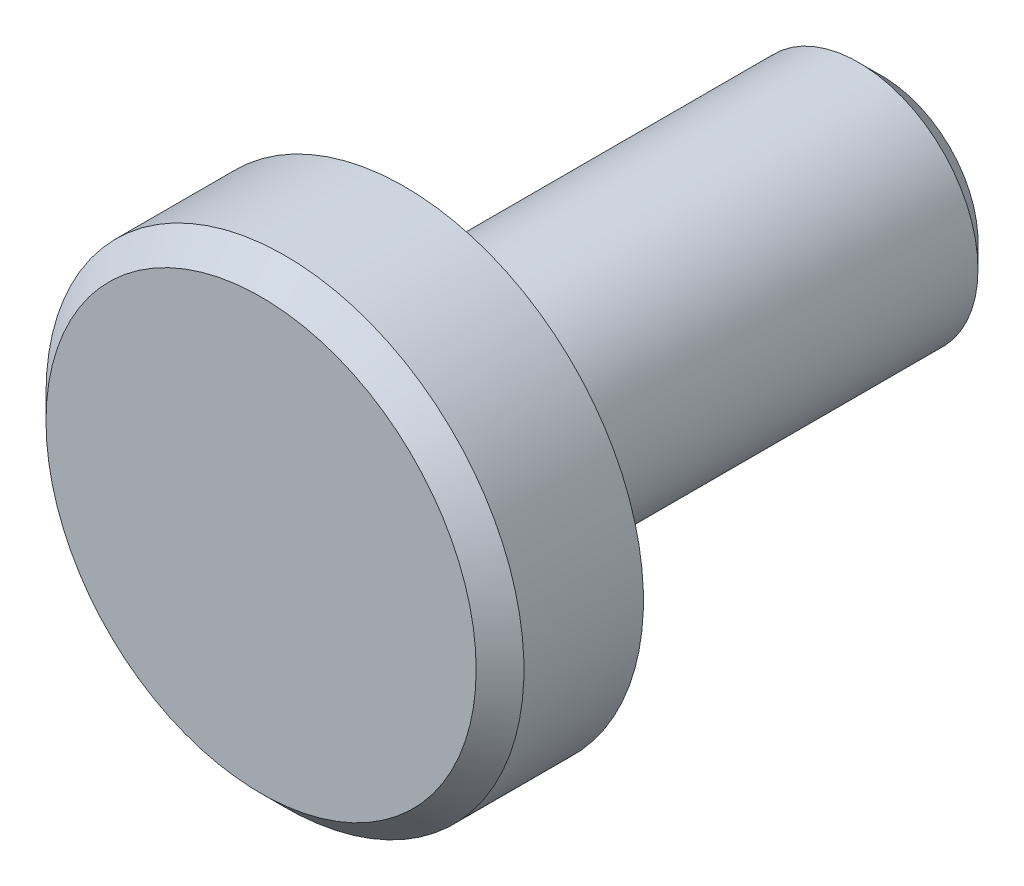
ISO-10303-21;
HEADER;
FILE_DESCRIPTION(('STEP AP214'),'2;1');
FILE_NAME('part.step','',(''),(''),'','','');
FILE_SCHEMA(('AUTOMOTIVE_DESIGN { 1 0 10303 214 1 1 1 1 }'));
ENDSEC;
DATA;
#1=APPLICATION_CONTEXT('core data for automotive mechanical design processes');
#2=APPLICATION_PROTOCOL_DEFINITION('international standard','automotive_design',2000,#1);
#3=PRODUCT_CONTEXT('',#1,'mechanical');
#4=PRODUCT('Part','Part','',(#3));
#5=PRODUCT_RELATED_PRODUCT_CATEGORY('part','',(#4));
#6=PRODUCT_DEFINITION_FORMATION('','',#4);
#7=PRODUCT_DEFINITION_CONTEXT('part definition',#1,'design');
#8=PRODUCT_DEFINITION('design','',#6,#7);
#9=PRODUCT_DEFINITION_SHAPE('','',#8);
#10=(LENGTH_UNIT() NAMED_UNIT(*) SI_UNIT(.MILLI.,.METRE.));
#11=(NAMED_UNIT(*) PLANE_ANGLE_UNIT() SI_UNIT($,.RADIAN.));
#12=(NAMED_UNIT(*) SI_UNIT($,.STERADIAN.) SOLID_ANGLE_UNIT());
#13=UNCERTAINTY_MEASURE_WITH_UNIT(LENGTH_MEASURE(1.E-05),#10,'distance_accuracy_value','');
#14=(GEOMETRIC_REPRESENTATION_CONTEXT(3) GLOBAL_UNCERTAINTY_ASSIGNED_CONTEXT((#13)) GLOBAL_UNIT_ASSIGNED_CONTEXT((#10,
#11,#12)) REPRESENTATION_CONTEXT('',''));
#15=CARTESIAN_POINT('',(0.,0.,0.));
#16=DIRECTION('',(0.,0.,1.));
#17=DIRECTION('',(1.,0.,0.));
#18=AXIS2_PLACEMENT_3D('',#15,#16,#17);
#19=CARTESIAN_POINT('',(0.,0.,4.7625));
#20=DIRECTION('',(0.,0.,-1.));
#21=DIRECTION('',(-1.,0.,0.));
#22=AXIS2_PLACEMENT_3D('',#19,#20,#21);
#23=CYLINDRICAL_SURFACE('',#22,7.9375);
#24=CARTESIAN_POINT('',(0.,0.,3.96874999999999));
#25=DIRECTION('',(0.,0.,1.));
#26=DIRECTION('',(1.,0.,0.));
#27=AXIS2_PLACEMENT_3D('',#24,#25,#26);
#28=CIRCLE('',#27,7.9375);
#29=CARTESIAN_POINT('',(-7.9375,0.,3.96874999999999));
#30=VERTEX_POINT('',#29);
#31=EDGE_CURVE('E41',#30,#30,#28,.F.);
#32=CARTESIAN_POINT('',(0.,0.,0.));
#33=DIRECTION('',(0.,0.,1.));
#34=DIRECTION('',(1.,0.,0.));
#35=AXIS2_PLACEMENT_3D('',#32,#33,#34);
#36=CIRCLE('',#35,7.9375);
#37=CARTESIAN_POINT('',(-7.9375,0.,0.));
#38=VERTEX_POINT('',#37);
#39=EDGE_CURVE('E53',#38,#38,#36,.T.);
#40=CARTESIAN_POINT('',(-7.9375,0.,3.96874999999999));
#41=CARTESIAN_POINT('',(-7.9375,0.,3.92740885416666));
#42=CARTESIAN_POINT('',(-7.9375,0.,3.88606770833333));
#43=CARTESIAN_POINT('',(-7.9375,0.,3.80338541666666));
#44=CARTESIAN_POINT('',(-7.9375,0.,3.76204427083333));
#45=CARTESIAN_POINT('',(-7.9375,0.,3.67936197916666));
#46=CARTESIAN_POINT('',(-7.9375,0.,3.63802083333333));
#47=CARTESIAN_POINT('',(-7.9375,0.,3.55533854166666));
#48=CARTESIAN_POINT('',(-7.9375,0.,3.51399739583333));
#49=CARTESIAN_POINT('',(-7.9375,0.,3.43131510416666));
#50=CARTESIAN_POINT('',(-7.9375,0.,3.38997395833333));
#51=CARTESIAN_POINT('',(-7.9375,0.,3.30729166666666));
#52=CARTESIAN_POINT('',(-7.9375,0.,3.26595052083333));
#53=CARTESIAN_POINT('',(-7.9375,0.,3.18326822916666));
#54=CARTESIAN_POINT('',(-7.9375,0.,3.14192708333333));
#55=CARTESIAN_POINT('',(-7.9375,0.,3.05924479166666));
#56=CARTESIAN_POINT('',(-7.9375,0.,3.01790364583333));
#57=CARTESIAN_POINT('',(-7.9375,0.,2.93522135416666));
#58=CARTESIAN_POINT('',(-7.9375,0.,2.89388020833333));
#59=CARTESIAN_POINT('',(-7.9375,0.,2.81119791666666));
#60=CARTESIAN_POINT('',(-7.9375,0.,2.76985677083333));
#61=CARTESIAN_POINT('',(-7.9375,0.,2.68717447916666));
#62=CARTESIAN_POINT('',(-7.9375,0.,2.64583333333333));
#63=CARTESIAN_POINT('',(-7.9375,0.,2.56315104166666));
#64=CARTESIAN_POINT('',(-7.9375,0.,2.52180989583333));
#65=CARTESIAN_POINT('',(-7.9375,0.,2.43912760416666));
#66=CARTESIAN_POINT('',(-7.9375,0.,2.39778645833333));
#67=CARTESIAN_POINT('',(-7.9375,0.,2.31510416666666));
#68=CARTESIAN_POINT('',(-7.9375,0.,2.27376302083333));
#69=CARTESIAN_POINT('',(-7.9375,0.,2.19108072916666));
#70=CARTESIAN_POINT('',(-7.9375,0.,2.14973958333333));
#71=CARTESIAN_POINT('',(-7.9375,0.,2.06705729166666));
#72=CARTESIAN_POINT('',(-7.9375,0.,2.02571614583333));
#73=CARTESIAN_POINT('',(-7.9375,0.,1.94303385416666));
#74=CARTESIAN_POINT('',(-7.9375,0.,1.90169270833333));
#75=CARTESIAN_POINT('',(-7.9375,0.,1.81901041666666));
#76=CARTESIAN_POINT('',(-7.9375,0.,1.77766927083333));
#77=CARTESIAN_POINT('',(-7.9375,0.,1.69498697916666));
#78=CARTESIAN_POINT('',(-7.9375,0.,1.65364583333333));
#79=CARTESIAN_POINT('',(-7.9375,0.,1.57096354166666));
#80=CARTESIAN_POINT('',(-7.9375,0.,1.52962239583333));
#81=CARTESIAN_POINT('',(-7.9375,0.,1.44694010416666));
#82=CARTESIAN_POINT('',(-7.9375,0.,1.40559895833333));
#83=CARTESIAN_POINT('',(-7.9375,0.,1.32291666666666));
#84=CARTESIAN_POINT('',(-7.9375,0.,1.28157552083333));
#85=CARTESIAN_POINT('',(-7.9375,0.,1.19889322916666));
#86=CARTESIAN_POINT('',(-7.9375,0.,1.15755208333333));
#87=CARTESIAN_POINT('',(-7.9375,0.,1.07486979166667));
#88=CARTESIAN_POINT('',(-7.9375,0.,1.03352864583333));
#89=CARTESIAN_POINT('',(-7.9375,0.,0.950846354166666));
#90=CARTESIAN_POINT('',(-7.9375,0.,0.909505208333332));
#91=CARTESIAN_POINT('',(-7.9375,0.,0.826822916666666));
#92=CARTESIAN_POINT('',(-7.9375,0.,0.785481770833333));
#93=CARTESIAN_POINT('',(-7.9375,0.,0.702799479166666));
#94=CARTESIAN_POINT('',(-7.9375,0.,0.661458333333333));
#95=CARTESIAN_POINT('',(-7.9375,0.,0.578776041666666));
#96=CARTESIAN_POINT('',(-7.9375,0.,0.537434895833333));
#97=CARTESIAN_POINT('',(-7.9375,0.,0.454752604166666));
#98=CARTESIAN_POINT('',(-7.9375,0.,0.413411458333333));
#99=CARTESIAN_POINT('',(-7.9375,0.,0.330729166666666));
#100=CARTESIAN_POINT('',(-7.9375,0.,0.289388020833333));
#101=CARTESIAN_POINT('',(-7.9375,0.,0.206705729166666));
#102=CARTESIAN_POINT('',(-7.9375,0.,0.165364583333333));
#103=CARTESIAN_POINT('',(-7.9375,0.,0.0826822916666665));
#104=CARTESIAN_POINT('',(-7.9375,0.,0.0413411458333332));
#105=CARTESIAN_POINT('',(-7.9375,0.,0.));
#106=B_SPLINE_CURVE_WITH_KNOTS('',3,(#40,#41,#42,#43,#44,#45,#46,#47,#48,#49,#50,#51,#52,#53,
#54,#55,#56,#57,#58,#59,#60,#61,#62,#63,#64,#65,#66,#67,#68,#69,#70,#71,#72,#73,#74,#75,#76,#77,
#78,#79,#80,#81,#82,#83,#84,#85,#86,#87,#88,#89,#90,#91,#92,#93,#94,#95,#96,#97,#98,#99,#100,
#101,#102,#103,#104,#105),.UNSPECIFIED.,.F.,.F.,(4,2,2,2,2,2,2,2,2,2,2,2,2,2,2,2,2,2,2,2,2,2,2,
2,2,2,2,2,2,2,2,2,4),(0.,0.124023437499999,0.248046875,0.372070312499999,0.496093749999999,
0.620117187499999,0.744140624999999,0.868164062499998,0.992187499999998,1.1162109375,
1.240234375,1.3642578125,1.48828125,1.6123046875,1.736328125,1.8603515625,1.984375,2.1083984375,
2.232421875,2.3564453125,2.48046875,2.6044921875,2.728515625,2.8525390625,2.9765625,
3.1005859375,3.22460937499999,3.34863281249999,3.47265624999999,3.59667968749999,
3.72070312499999,3.84472656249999,3.96874999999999),.UNSPECIFIED.);
#107=EDGE_CURVE('BSEAM30',#30,#38,#106,.T.);
#108=ORIENTED_EDGE('',*,*,#31,.T.);
#109=ORIENTED_EDGE('',*,*,#39,.T.);
#110=ORIENTED_EDGE('',*,*,#107,.T.);
#111=ORIENTED_EDGE('',*,*,#107,.F.);
#112=EDGE_LOOP('',(#108,#110,#109,#111));
#113=FACE_BOUND('',#112,.T.);
#114=ADVANCED_FACE('F30',(#113),#23,.T.);
#115=CARTESIAN_POINT('',(0.,0.,4.7625));
#116=DIRECTION('',(0.,0.,1.));
#117=DIRECTION('',(1.,0.,0.));
#118=AXIS2_PLACEMENT_3D('',#115,#116,#117);
#119=PLANE('',#118);
#120=CARTESIAN_POINT('',(0.,0.,4.7625));
#121=DIRECTION('',(0.,0.,1.));
#122=DIRECTION('',(1.,0.,0.));
#123=AXIS2_PLACEMENT_3D('',#120,#121,#122);
#124=CIRCLE('',#123,7.14374999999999);
#125=CARTESIAN_POINT('',(7.14374999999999,0.,4.7625));
#126=VERTEX_POINT('',#125);
#127=EDGE_CURVE('E45',#126,#126,#124,.T.);
#128=ORIENTED_EDGE('',*,*,#127,.T.);
#129=EDGE_LOOP('',(#128));
#130=FACE_BOUND('',#129,.T.);
#131=ADVANCED_FACE('F61',(#130),#119,.T.);
#132=CARTESIAN_POINT('',(0.,0.,0.));
#133=DIRECTION('',(0.,0.,1.));
#134=DIRECTION('',(1.,0.,0.));
#135=AXIS2_PLACEMENT_3D('',#132,#133,#134);
#136=PLANE('',#135);
#137=CARTESIAN_POINT('',(0.,0.,0.));
#138=DIRECTION('',(0.,0.,1.));
#139=DIRECTION('',(1.,0.,0.));
#140=AXIS2_PLACEMENT_3D('',#137,#138,#139);
#141=CIRCLE('',#140,3.96875);
#142=CARTESIAN_POINT('',(3.96875,0.,0.));
#143=VERTEX_POINT('',#142);
#144=EDGE_CURVE('E50',#143,#143,#141,.F.);
#145=ORIENTED_EDGE('',*,*,#144,.F.);
#146=EDGE_LOOP('',(#145));
#147=FACE_BOUND('',#146,.T.);
#148=ORIENTED_EDGE('',*,*,#39,.F.);
#149=EDGE_LOOP('',(#148));
#150=FACE_BOUND('',#149,.T.);
#151=ADVANCED_FACE('F58',(#147,#150),#136,.F.);
#152=CARTESIAN_POINT('',(0.,0.,-15.875));
#153=DIRECTION('',(0.,0.,1.));
#154=DIRECTION('',(1.,0.,0.));
#155=AXIS2_PLACEMENT_3D('',#152,#153,#154);
#156=CYLINDRICAL_SURFACE('',#155,3.96875);
#157=CARTESIAN_POINT('',(0.,0.,-15.08125));
#158=DIRECTION('',(0.,0.,-1.));
#159=DIRECTION('',(-1.,0.,0.));
#160=AXIS2_PLACEMENT_3D('',#157,#158,#159);
#161=CIRCLE('',#160,3.96875);
#162=CARTESIAN_POINT('',(-3.96875,0.,-15.08125));
#163=VERTEX_POINT('',#162);
#164=EDGE_CURVE('E10',#163,#163,#161,.F.);
#165=ORIENTED_EDGE('',*,*,#164,.T.);
#166=EDGE_LOOP('',(#165));
#167=FACE_BOUND('',#166,.T.);
#168=ORIENTED_EDGE('',*,*,#144,.T.);
#169=EDGE_LOOP('',(#168));
#170=FACE_BOUND('',#169,.T.);
#171=ADVANCED_FACE('F60',(#167,#170),#156,.T.);
#172=CARTESIAN_POINT('',(0.,0.,-15.875));
#173=DIRECTION('',(0.,0.,-1.));
#174=DIRECTION('',(-1.,0.,0.));
#175=AXIS2_PLACEMENT_3D('',#172,#173,#174);
#176=PLANE('',#175);
#177=CARTESIAN_POINT('',(0.,0.,-15.875));
#178=DIRECTION('',(0.,0.,-1.));
#179=DIRECTION('',(-1.,0.,0.));
#180=AXIS2_PLACEMENT_3D('',#177,#178,#179);
#181=CIRCLE('',#180,3.17499999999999);
#182=CARTESIAN_POINT('',(-3.17499999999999,0.,-15.875));
#183=VERTEX_POINT('',#182);
#184=EDGE_CURVE('E37',#183,#183,#181,.T.);
#185=ORIENTED_EDGE('',*,*,#184,.T.);
#186=EDGE_LOOP('',(#185));
#187=FACE_BOUND('',#186,.T.);
#188=ADVANCED_FACE('F68',(#187),#176,.T.);
#189=CARTESIAN_POINT('',(0.,0.,4.7625));
#190=DIRECTION('',(0.,0.,-1.));
#191=DIRECTION('',(-1.,0.,0.));
#192=AXIS2_PLACEMENT_3D('',#189,#190,#191);
#193=CONICAL_SURFACE('',#192,7.14374999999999,0.785398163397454);
#194=ORIENTED_EDGE('',*,*,#31,.F.);
#195=EDGE_LOOP('',(#194));
#196=FACE_BOUND('',#195,.T.);
#197=ORIENTED_EDGE('',*,*,#127,.F.);
#198=EDGE_LOOP('',(#197));
#199=FACE_BOUND('',#198,.T.);
#200=ADVANCED_FACE('F78',(#196,#199),#193,.T.);
#201=CARTESIAN_POINT('',(0.,0.,-15.875));
#202=DIRECTION('',(0.,0.,1.));
#203=DIRECTION('',(1.,0.,0.));
#204=AXIS2_PLACEMENT_3D('',#201,#202,#203);
#205=CONICAL_SURFACE('',#204,3.17499999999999,0.785398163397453);
#206=ORIENTED_EDGE('',*,*,#164,.F.);
#207=EDGE_LOOP('',(#206));
#208=FACE_BOUND('',#207,.T.);
#209=ORIENTED_EDGE('',*,*,#184,.F.);
#210=EDGE_LOOP('',(#209));
#211=FACE_BOUND('',#210,.T.);
#212=ADVANCED_FACE('F32',(#208,#211),#205,.T.);
#213=CLOSED_SHELL('',(#114,#131,#151,#171,#188,#200,#212));
#214=MANIFOLD_SOLID_BREP('B2',#213);
#215=ADVANCED_BREP_SHAPE_REPRESENTATION('',(#18,#214),#14);
#216=SHAPE_DEFINITION_REPRESENTATION(#9,#215);
ENDSEC;
END-ISO-10303-21;
